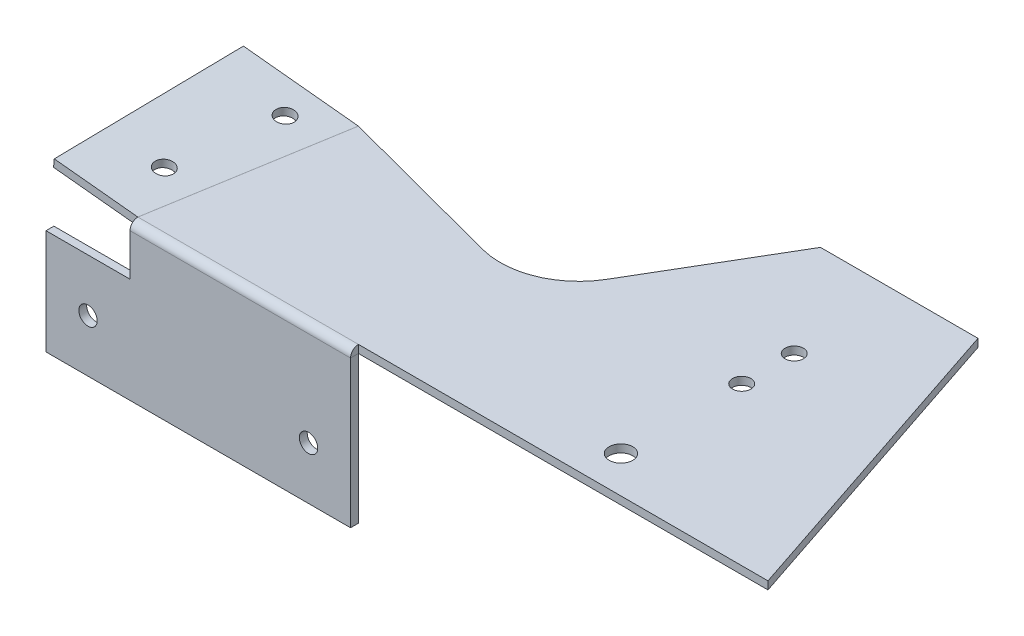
ISO-10303-21;
HEADER;
FILE_DESCRIPTION(('STEP AP214'),'2;1');
FILE_NAME('part.step','',(''),(''),'','','');
FILE_SCHEMA(('AUTOMOTIVE_DESIGN { 1 0 10303 214 1 1 1 1 }'));
ENDSEC;
DATA;
#1=APPLICATION_CONTEXT('core data for automotive mechanical design processes');
#2=APPLICATION_PROTOCOL_DEFINITION('international standard','automotive_design',2000,#1);
#3=PRODUCT_CONTEXT('',#1,'mechanical');
#4=PRODUCT('Part','Part','',(#3));
#5=PRODUCT_RELATED_PRODUCT_CATEGORY('part','',(#4));
#6=PRODUCT_DEFINITION_FORMATION('','',#4);
#7=PRODUCT_DEFINITION_CONTEXT('part definition',#1,'design');
#8=PRODUCT_DEFINITION('design','',#6,#7);
#9=PRODUCT_DEFINITION_SHAPE('','',#8);
#10=(LENGTH_UNIT() NAMED_UNIT(*) SI_UNIT(.MILLI.,.METRE.));
#11=(NAMED_UNIT(*) PLANE_ANGLE_UNIT() SI_UNIT($,.RADIAN.));
#12=(NAMED_UNIT(*) SI_UNIT($,.STERADIAN.) SOLID_ANGLE_UNIT());
#13=UNCERTAINTY_MEASURE_WITH_UNIT(LENGTH_MEASURE(1.E-05),#10,'distance_accuracy_value','');
#14=(GEOMETRIC_REPRESENTATION_CONTEXT(3) GLOBAL_UNCERTAINTY_ASSIGNED_CONTEXT((#13)) GLOBAL_UNIT_ASSIGNED_CONTEXT((#10,
#11,#12)) REPRESENTATION_CONTEXT('',''));
#15=CARTESIAN_POINT('',(0.,0.,0.));
#16=DIRECTION('',(0.,0.,1.));
#17=DIRECTION('',(1.,0.,0.));
#18=AXIS2_PLACEMENT_3D('',#15,#16,#17);
#19=CARTESIAN_POINT('',(58.,0.,-70.));
#20=DIRECTION('',(0.,1.,0.));
#21=DIRECTION('',(0.,0.,1.));
#22=AXIS2_PLACEMENT_3D('',#19,#20,#21);
#23=PLANE('',#22);
#24=CARTESIAN_POINT('',(101.,0.,-68.));
#25=DIRECTION('',(0.,1.,0.));
#26=DIRECTION('',(0.,0.,1.));
#27=AXIS2_PLACEMENT_3D('',#24,#25,#26);
#28=CIRCLE('',#27,1.75);
#29=CARTESIAN_POINT('',(101.,0.,-66.25));
#30=VERTEX_POINT('',#29);
#31=EDGE_CURVE('E336',#30,#30,#28,.T.);
#32=ORIENTED_EDGE('',*,*,#31,.T.);
#33=EDGE_LOOP('',(#32));
#34=FACE_BOUND('',#33,.T.);
#35=CARTESIAN_POINT('',(101.,0.,-35.));
#36=DIRECTION('',(0.,1.,0.));
#37=DIRECTION('',(0.,0.,1.));
#38=AXIS2_PLACEMENT_3D('',#35,#36,#37);
#39=CIRCLE('',#38,2.25);
#40=CARTESIAN_POINT('',(101.,0.,-32.75));
#41=VERTEX_POINT('',#40);
#42=EDGE_CURVE('E340',#41,#41,#39,.T.);
#43=ORIENTED_EDGE('',*,*,#42,.T.);
#44=EDGE_LOOP('',(#43));
#45=FACE_BOUND('',#44,.T.);
#46=CARTESIAN_POINT('',(101.,0.,-58.));
#47=DIRECTION('',(0.,1.,0.));
#48=DIRECTION('',(0.,0.,1.));
#49=AXIS2_PLACEMENT_3D('',#46,#47,#48);
#50=CIRCLE('',#49,1.75);
#51=CARTESIAN_POINT('',(101.,0.,-56.25));
#52=VERTEX_POINT('',#51);
#53=EDGE_CURVE('E343',#52,#52,#50,.T.);
#54=ORIENTED_EDGE('',*,*,#53,.T.);
#55=EDGE_LOOP('',(#54));
#56=FACE_BOUND('',#55,.T.);
#57=DIRECTION('',(1.,0.,0.));
#58=VECTOR('',#57,1.);
#59=CARTESIAN_POINT('',(58.,0.,-28.));
#60=LINE('',#59,#58);
#61=CARTESIAN_POINT('',(16.,0.,-28.));
#62=VERTEX_POINT('',#61);
#63=CARTESIAN_POINT('',(58.,0.,-28.));
#64=VERTEX_POINT('',#63);
#65=EDGE_CURVE('E330',#62,#64,#60,.T.);
#66=ORIENTED_EDGE('',*,*,#65,.F.);
#67=DIRECTION('',(0.164398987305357,0.,-0.986393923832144));
#68=VECTOR('',#67,1.);
#69=CARTESIAN_POINT('',(23.9459459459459,0.,-75.6756756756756));
#70=LINE('',#69,#68);
#71=CARTESIAN_POINT('',(22.0000000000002,0.,-64.));
#72=VERTEX_POINT('',#71);
#73=EDGE_CURVE('E64',#62,#72,#70,.T.);
#74=ORIENTED_EDGE('',*,*,#73,.T.);
#75=DIRECTION('',(-0.966800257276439,0.,-0.255533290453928));
#76=VECTOR('',#75,1.);
#77=CARTESIAN_POINT('',(54.1670006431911,0.,-55.4979961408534));
#78=LINE('',#77,#76);
#79=CARTESIAN_POINT('',(54.1670006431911,0.,-55.4979961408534));
#80=VERTEX_POINT('',#79);
#81=EDGE_CURVE('E395',#80,#72,#78,.T.);
#82=ORIENTED_EDGE('',*,*,#81,.F.);
#83=CARTESIAN_POINT('',(58.,0.,-70.));
#84=DIRECTION('',(0.,-1.,0.));
#85=DIRECTION('',(0.,0.,1.));
#86=AXIS2_PLACEMENT_3D('',#83,#84,#85);
#87=CIRCLE('',#86,15.);
#88=CARTESIAN_POINT('',(70.9270174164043,0.,-62.3913062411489));
#89=VERTEX_POINT('',#88);
#90=EDGE_CURVE('E390',#89,#80,#87,.T.);
#91=ORIENTED_EDGE('',*,*,#90,.F.);
#92=DIRECTION('',(-0.507246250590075,0.,0.861801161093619));
#93=VECTOR('',#92,1.);
#94=CARTESIAN_POINT('',(86.,0.,-88.));
#95=LINE('',#94,#93);
#96=CARTESIAN_POINT('',(86.,0.,-88.));
#97=VERTEX_POINT('',#96);
#98=EDGE_CURVE('E385',#97,#89,#95,.T.);
#99=ORIENTED_EDGE('',*,*,#98,.F.);
#100=DIRECTION('',(-1.,0.,0.));
#101=VECTOR('',#100,1.);
#102=CARTESIAN_POINT('',(116.,0.,-88.));
#103=LINE('',#102,#101);
#104=CARTESIAN_POINT('',(116.,0.,-88.));
#105=VERTEX_POINT('',#104);
#106=EDGE_CURVE('E380',#105,#97,#103,.T.);
#107=ORIENTED_EDGE('',*,*,#106,.F.);
#108=DIRECTION('',(-0.316227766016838,0.,-0.948683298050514));
#109=VECTOR('',#108,1.);
#110=CARTESIAN_POINT('',(136.,0.,-28.));
#111=LINE('',#110,#109);
#112=CARTESIAN_POINT('',(136.,0.,-28.));
#113=VERTEX_POINT('',#112);
#114=EDGE_CURVE('E375',#113,#105,#111,.T.);
#115=ORIENTED_EDGE('',*,*,#114,.F.);
#116=DIRECTION('',(1.,0.,0.));
#117=VECTOR('',#116,1.);
#118=CARTESIAN_POINT('',(58.,0.,-28.));
#119=LINE('',#118,#117);
#120=EDGE_CURVE('E349',#64,#113,#119,.T.);
#121=ORIENTED_EDGE('',*,*,#120,.F.);
#122=EDGE_LOOP('',(#66,#74,#82,#91,#99,#107,#115,#121));
#123=FACE_BOUND('',#122,.T.);
#124=ADVANCED_FACE('F54',(#34,#45,#56,#123),#23,.F.);
#125=CARTESIAN_POINT('',(16.,0.000594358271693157,-26.499));
#126=DIRECTION('',(1.,0.,0.));
#127=DIRECTION('',(0.,1.,0.));
#128=AXIS2_PLACEMENT_3D('',#125,#126,#127);
#129=PLANE('',#128);
#130=DIRECTION('',(0.,-1.,0.));
#131=VECTOR('',#130,1.);
#132=CARTESIAN_POINT('',(16.,0.000594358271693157,-26.499));
#133=LINE('',#132,#131);
#134=CARTESIAN_POINT('',(16.,-0.00100000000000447,-26.499));
#135=VERTEX_POINT('',#134);
#136=CARTESIAN_POINT('',(16.,-7.9994056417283,-26.499));
#137=VERTEX_POINT('',#136);
#138=EDGE_CURVE('E418',#135,#137,#133,.T.);
#139=ORIENTED_EDGE('',*,*,#138,.F.);
#140=DIRECTION('',(0.,0.,-1.));
#141=VECTOR('',#140,1.);
#142=CARTESIAN_POINT('',(16.,-0.00100000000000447,-26.499));
#143=LINE('',#142,#141);
#144=CARTESIAN_POINT('',(16.,-0.000999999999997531,-27.999));
#145=VERTEX_POINT('',#144);
#146=EDGE_CURVE('E443',#135,#145,#143,.T.);
#147=ORIENTED_EDGE('',*,*,#146,.T.);
#148=DIRECTION('',(0.,-1.,0.));
#149=VECTOR('',#148,1.);
#150=CARTESIAN_POINT('',(16.,0.000594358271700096,-27.999));
#151=LINE('',#150,#149);
#152=CARTESIAN_POINT('',(16.,-7.9994056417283,-27.999));
#153=VERTEX_POINT('',#152);
#154=EDGE_CURVE('E80',#145,#153,#151,.T.);
#155=ORIENTED_EDGE('',*,*,#154,.T.);
#156=DIRECTION('',(0.,0.,-1.));
#157=VECTOR('',#156,1.);
#158=CARTESIAN_POINT('',(16.,-7.9994056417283,-26.499));
#159=LINE('',#158,#157);
#160=EDGE_CURVE('E427',#137,#153,#159,.T.);
#161=ORIENTED_EDGE('',*,*,#160,.F.);
#162=EDGE_LOOP('',(#139,#147,#155,#161));
#163=FACE_BOUND('',#162,.T.);
#164=ADVANCED_FACE('F539',(#163),#129,.F.);
#165=CARTESIAN_POINT('',(58.,-27.9994056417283,-26.4990000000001));
#166=DIRECTION('',(-1.,0.,0.));
#167=DIRECTION('',(0.,-1.,0.));
#168=AXIS2_PLACEMENT_3D('',#165,#166,#167);
#169=PLANE('',#168);
#170=DIRECTION('',(0.,1.,0.));
#171=VECTOR('',#170,1.);
#172=CARTESIAN_POINT('',(58.,-27.9994056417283,-27.9990000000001));
#173=LINE('',#172,#171);
#174=CARTESIAN_POINT('',(58.,-27.9994056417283,-27.9990000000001));
#175=VERTEX_POINT('',#174);
#176=CARTESIAN_POINT('',(58.,-0.000999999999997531,-27.999));
#177=VERTEX_POINT('',#176);
#178=EDGE_CURVE('E423',#175,#177,#173,.T.);
#179=ORIENTED_EDGE('',*,*,#178,.T.);
#180=DIRECTION('',(0.,0.,1.));
#181=VECTOR('',#180,1.);
#182=CARTESIAN_POINT('',(58.,-0.00100000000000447,-26.499));
#183=LINE('',#182,#181);
#184=CARTESIAN_POINT('',(58.,-0.00100000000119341,-26.499));
#185=VERTEX_POINT('',#184);
#186=EDGE_CURVE('E439',#177,#185,#183,.T.);
#187=ORIENTED_EDGE('',*,*,#186,.T.);
#188=DIRECTION('',(0.,1.,0.));
#189=VECTOR('',#188,1.);
#190=CARTESIAN_POINT('',(58.,-27.9994056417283,-26.4990000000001));
#191=LINE('',#190,#189);
#192=CARTESIAN_POINT('',(58.,-27.9994056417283,-26.4990000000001));
#193=VERTEX_POINT('',#192);
#194=EDGE_CURVE('E414',#193,#185,#191,.T.);
#195=ORIENTED_EDGE('',*,*,#194,.F.);
#196=DIRECTION('',(0.,0.,-1.));
#197=VECTOR('',#196,1.);
#198=CARTESIAN_POINT('',(58.,-27.9994056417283,-26.4990000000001));
#199=LINE('',#198,#197);
#200=EDGE_CURVE('E430',#193,#175,#199,.T.);
#201=ORIENTED_EDGE('',*,*,#200,.T.);
#202=EDGE_LOOP('',(#179,#187,#195,#201));
#203=FACE_BOUND('',#202,.T.);
#204=ADVANCED_FACE('F544',(#203),#169,.F.);
#205=CARTESIAN_POINT('',(58.,42.0005943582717,-27.9989999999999));
#206=DIRECTION('',(0.,0.,1.));
#207=DIRECTION('',(0.,-1.,0.));
#208=AXIS2_PLACEMENT_3D('',#205,#206,#207);
#209=PLANE('',#208);
#210=CARTESIAN_POINT('',(50.,-17.9994056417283,-27.9990000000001));
#211=DIRECTION('',(0.,0.,1.));
#212=DIRECTION('',(0.,-1.,0.));
#213=AXIS2_PLACEMENT_3D('',#210,#211,#212);
#214=CIRCLE('',#213,1.75);
#215=CARTESIAN_POINT('',(50.,-19.7494056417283,-27.9990000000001));
#216=VERTEX_POINT('',#215);
#217=EDGE_CURVE('E339',#216,#216,#214,.T.);
#218=ORIENTED_EDGE('',*,*,#217,.T.);
#219=EDGE_LOOP('',(#218));
#220=FACE_BOUND('',#219,.T.);
#221=CARTESIAN_POINT('',(8.,-17.9994056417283,-27.9990000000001));
#222=DIRECTION('',(0.,0.,1.));
#223=DIRECTION('',(0.,-1.,0.));
#224=AXIS2_PLACEMENT_3D('',#221,#222,#223);
#225=CIRCLE('',#224,1.75);
#226=CARTESIAN_POINT('',(8.,-19.7494056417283,-27.9990000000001));
#227=VERTEX_POINT('',#226);
#228=EDGE_CURVE('E399',#227,#227,#225,.T.);
#229=ORIENTED_EDGE('',*,*,#228,.T.);
#230=EDGE_LOOP('',(#229));
#231=FACE_BOUND('',#230,.T.);
#232=ORIENTED_EDGE('',*,*,#154,.F.);
#233=DIRECTION('',(1.,0.,0.));
#234=VECTOR('',#233,1.);
#235=CARTESIAN_POINT('',(58.,-0.001000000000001,-27.999));
#236=LINE('',#235,#234);
#237=EDGE_CURVE('E441',#145,#177,#236,.T.);
#238=ORIENTED_EDGE('',*,*,#237,.T.);
#239=ORIENTED_EDGE('',*,*,#178,.F.);
#240=DIRECTION('',(1.,0.,0.));
#241=VECTOR('',#240,1.);
#242=CARTESIAN_POINT('',(0.,-27.9994056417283,-27.9990000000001));
#243=LINE('',#242,#241);
#244=CARTESIAN_POINT('',(0.,-27.9994056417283,-27.9990000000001));
#245=VERTEX_POINT('',#244);
#246=EDGE_CURVE('E421',#245,#175,#243,.T.);
#247=ORIENTED_EDGE('',*,*,#246,.F.);
#248=DIRECTION('',(0.,-1.,0.));
#249=VECTOR('',#248,1.);
#250=CARTESIAN_POINT('',(0.,-7.9994056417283,-27.999));
#251=LINE('',#250,#249);
#252=CARTESIAN_POINT('',(0.,-7.9994056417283,-27.999));
#253=VERTEX_POINT('',#252);
#254=EDGE_CURVE('E405',#253,#245,#251,.T.);
#255=ORIENTED_EDGE('',*,*,#254,.F.);
#256=DIRECTION('',(-1.,0.,0.));
#257=VECTOR('',#256,1.);
#258=CARTESIAN_POINT('',(16.,-7.9994056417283,-27.999));
#259=LINE('',#258,#257);
#260=EDGE_CURVE('E412',#153,#253,#259,.T.);
#261=ORIENTED_EDGE('',*,*,#260,.F.);
#262=EDGE_LOOP('',(#232,#238,#239,#247,#255,#261));
#263=FACE_BOUND('',#262,.T.);
#264=ADVANCED_FACE('F803',(#220,#231,#263),#209,.F.);
#265=CARTESIAN_POINT('',(58.,42.0005943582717,-26.4989999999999));
#266=DIRECTION('',(0.,0.,1.));
#267=DIRECTION('',(0.,-1.,0.));
#268=AXIS2_PLACEMENT_3D('',#265,#266,#267);
#269=PLANE('',#268);
#270=DIRECTION('',(1.,0.,0.));
#271=VECTOR('',#270,1.);
#272=CARTESIAN_POINT('',(58.,-0.00100000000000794,-26.499));
#273=LINE('',#272,#271);
#274=EDGE_CURVE('E436',#135,#185,#273,.T.);
#275=ORIENTED_EDGE('',*,*,#274,.F.);
#276=ORIENTED_EDGE('',*,*,#138,.T.);
#277=DIRECTION('',(-1.,0.,0.));
#278=VECTOR('',#277,1.);
#279=CARTESIAN_POINT('',(16.,-7.9994056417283,-26.499));
#280=LINE('',#279,#278);
#281=CARTESIAN_POINT('',(0.,-7.99940564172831,-26.499));
#282=VERTEX_POINT('',#281);
#283=EDGE_CURVE('E415',#137,#282,#280,.T.);
#284=ORIENTED_EDGE('',*,*,#283,.T.);
#285=DIRECTION('',(0.,-1.,0.));
#286=VECTOR('',#285,1.);
#287=CARTESIAN_POINT('',(0.,-7.99940564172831,-26.499));
#288=LINE('',#287,#286);
#289=CARTESIAN_POINT('',(0.,-27.9994056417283,-26.4990000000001));
#290=VERTEX_POINT('',#289);
#291=EDGE_CURVE('E408',#282,#290,#288,.T.);
#292=ORIENTED_EDGE('',*,*,#291,.T.);
#293=DIRECTION('',(1.,0.,0.));
#294=VECTOR('',#293,1.);
#295=CARTESIAN_POINT('',(0.,-27.9994056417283,-26.4990000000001));
#296=LINE('',#295,#294);
#297=EDGE_CURVE('E411',#290,#193,#296,.T.);
#298=ORIENTED_EDGE('',*,*,#297,.T.);
#299=ORIENTED_EDGE('',*,*,#194,.T.);
#300=EDGE_LOOP('',(#275,#276,#284,#292,#298,#299));
#301=FACE_BOUND('',#300,.T.);
#302=CARTESIAN_POINT('',(50.,-17.9994056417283,-26.4990000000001));
#303=DIRECTION('',(0.,0.,1.));
#304=DIRECTION('',(0.,-1.,0.));
#305=AXIS2_PLACEMENT_3D('',#302,#303,#304);
#306=CIRCLE('',#305,1.75);
#307=CARTESIAN_POINT('',(50.,-19.7494056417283,-26.4990000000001));
#308=VERTEX_POINT('',#307);
#309=EDGE_CURVE('E396',#308,#308,#306,.T.);
#310=ORIENTED_EDGE('',*,*,#309,.F.);
#311=EDGE_LOOP('',(#310));
#312=FACE_BOUND('',#311,.T.);
#313=CARTESIAN_POINT('',(8.,-17.9994056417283,-26.4990000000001));
#314=DIRECTION('',(0.,0.,1.));
#315=DIRECTION('',(0.,-1.,0.));
#316=AXIS2_PLACEMENT_3D('',#313,#314,#315);
#317=CIRCLE('',#316,1.75);
#318=CARTESIAN_POINT('',(8.,-19.7494056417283,-26.4990000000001));
#319=VERTEX_POINT('',#318);
#320=EDGE_CURVE('E402',#319,#319,#317,.T.);
#321=ORIENTED_EDGE('',*,*,#320,.F.);
#322=EDGE_LOOP('',(#321));
#323=FACE_BOUND('',#322,.T.);
#324=ADVANCED_FACE('F795',(#301,#312,#323),#269,.T.);
#325=CARTESIAN_POINT('',(0.,-7.99940564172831,-26.499));
#326=DIRECTION('',(1.,0.,0.));
#327=DIRECTION('',(0.,1.,0.));
#328=AXIS2_PLACEMENT_3D('',#325,#326,#327);
#329=PLANE('',#328);
#330=ORIENTED_EDGE('',*,*,#254,.T.);
#331=DIRECTION('',(0.,0.,-1.));
#332=VECTOR('',#331,1.);
#333=CARTESIAN_POINT('',(0.,-27.9994056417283,-26.4990000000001));
#334=LINE('',#333,#332);
#335=EDGE_CURVE('E433',#290,#245,#334,.T.);
#336=ORIENTED_EDGE('',*,*,#335,.F.);
#337=ORIENTED_EDGE('',*,*,#291,.F.);
#338=DIRECTION('',(0.,0.,-1.));
#339=VECTOR('',#338,1.);
#340=CARTESIAN_POINT('',(0.,-7.99940564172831,-26.499));
#341=LINE('',#340,#339);
#342=EDGE_CURVE('E417',#282,#253,#341,.T.);
#343=ORIENTED_EDGE('',*,*,#342,.T.);
#344=EDGE_LOOP('',(#330,#336,#337,#343));
#345=FACE_BOUND('',#344,.T.);
#346=ADVANCED_FACE('F787',(#345),#329,.F.);
#347=CARTESIAN_POINT('',(0.,-27.9994056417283,-26.4990000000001));
#348=DIRECTION('',(0.,1.,0.));
#349=DIRECTION('',(-1.,0.,0.));
#350=AXIS2_PLACEMENT_3D('',#347,#348,#349);
#351=PLANE('',#350);
#352=ORIENTED_EDGE('',*,*,#246,.T.);
#353=ORIENTED_EDGE('',*,*,#200,.F.);
#354=ORIENTED_EDGE('',*,*,#297,.F.);
#355=ORIENTED_EDGE('',*,*,#335,.T.);
#356=EDGE_LOOP('',(#352,#353,#354,#355));
#357=FACE_BOUND('',#356,.T.);
#358=ADVANCED_FACE('F779',(#357),#351,.F.);
#359=CARTESIAN_POINT('',(16.,-7.9994056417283,-26.499));
#360=DIRECTION('',(0.,-1.,0.));
#361=DIRECTION('',(1.,0.,0.));
#362=AXIS2_PLACEMENT_3D('',#359,#360,#361);
#363=PLANE('',#362);
#364=ORIENTED_EDGE('',*,*,#260,.T.);
#365=ORIENTED_EDGE('',*,*,#342,.F.);
#366=ORIENTED_EDGE('',*,*,#283,.F.);
#367=ORIENTED_EDGE('',*,*,#160,.T.);
#368=EDGE_LOOP('',(#364,#365,#366,#367));
#369=FACE_BOUND('',#368,.T.);
#370=ADVANCED_FACE('F771',(#369),#363,.F.);
#371=CARTESIAN_POINT('',(8.,-17.9994056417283,-26.4990000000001));
#372=DIRECTION('',(0.,0.,-1.));
#373=DIRECTION('',(0.,1.,0.));
#374=AXIS2_PLACEMENT_3D('',#371,#372,#373);
#375=CYLINDRICAL_SURFACE('',#374,1.75);
#376=ORIENTED_EDGE('',*,*,#320,.T.);
#377=EDGE_LOOP('',(#376));
#378=FACE_BOUND('',#377,.T.);
#379=ORIENTED_EDGE('',*,*,#228,.F.);
#380=EDGE_LOOP('',(#379));
#381=FACE_BOUND('',#380,.T.);
#382=ADVANCED_FACE('F763',(#378,#381),#375,.F.);
#383=CARTESIAN_POINT('',(50.,-17.9994056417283,-26.4990000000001));
#384=DIRECTION('',(0.,0.,-1.));
#385=DIRECTION('',(0.,1.,0.));
#386=AXIS2_PLACEMENT_3D('',#383,#384,#385);
#387=CYLINDRICAL_SURFACE('',#386,1.75);
#388=ORIENTED_EDGE('',*,*,#309,.T.);
#389=EDGE_LOOP('',(#388));
#390=FACE_BOUND('',#389,.T.);
#391=ORIENTED_EDGE('',*,*,#217,.F.);
#392=EDGE_LOOP('',(#391));
#393=FACE_BOUND('',#392,.T.);
#394=ADVANCED_FACE('F487',(#390,#393),#387,.F.);
#395=CARTESIAN_POINT('',(54.1670006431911,1.5,-55.4979961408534));
#396=DIRECTION('',(-0.255533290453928,0.,0.966800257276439));
#397=DIRECTION('',(0.966800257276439,0.,0.255533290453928));
#398=AXIS2_PLACEMENT_3D('',#395,#396,#397);
#399=PLANE('',#398);
#400=ORIENTED_EDGE('',*,*,#81,.T.);
#401=CARTESIAN_POINT('',(22.,1.5,-64.));
#402=CARTESIAN_POINT('',(22.0000000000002,0.,-64.));
#403=B_SPLINE_CURVE_WITH_KNOTS('',1,(#401,#402),.UNSPECIFIED.,.F.,.F.,(2,2),(0.,1.),.UNSPECIFIED.);
#404=CARTESIAN_POINT('',(22.,1.5,-64.));
#405=VERTEX_POINT('',#404);
#406=EDGE_CURVE('E318',#405,#72,#403,.T.);
#407=ORIENTED_EDGE('',*,*,#406,.F.);
#408=DIRECTION('',(-0.966800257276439,0.,-0.255533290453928));
#409=VECTOR('',#408,1.);
#410=CARTESIAN_POINT('',(54.1670006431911,1.5,-55.4979961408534));
#411=LINE('',#410,#409);
#412=CARTESIAN_POINT('',(54.1670006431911,1.5,-55.4979961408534));
#413=VERTEX_POINT('',#412);
#414=EDGE_CURVE('E351',#413,#405,#411,.T.);
#415=ORIENTED_EDGE('',*,*,#414,.F.);
#416=DIRECTION('',(0.,-1.,0.));
#417=VECTOR('',#416,1.);
#418=CARTESIAN_POINT('',(54.1670006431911,1.5,-55.4979961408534));
#419=LINE('',#418,#417);
#420=EDGE_CURVE('E392',#413,#80,#419,.T.);
#421=ORIENTED_EDGE('',*,*,#420,.T.);
#422=EDGE_LOOP('',(#400,#407,#415,#421));
#423=FACE_BOUND('',#422,.T.);
#424=ADVANCED_FACE('F482',(#423),#399,.F.);
#425=CARTESIAN_POINT('',(58.,1.5,-70.));
#426=DIRECTION('',(0.,-1.,0.));
#427=DIRECTION('',(0.,0.,-1.));
#428=AXIS2_PLACEMENT_3D('',#425,#426,#427);
#429=CYLINDRICAL_SURFACE('',#428,15.);
#430=ORIENTED_EDGE('',*,*,#90,.T.);
#431=ORIENTED_EDGE('',*,*,#420,.F.);
#432=CARTESIAN_POINT('',(58.,1.5,-70.));
#433=DIRECTION('',(0.,-1.,0.));
#434=DIRECTION('',(0.,0.,1.));
#435=AXIS2_PLACEMENT_3D('',#432,#433,#434);
#436=CIRCLE('',#435,15.);
#437=CARTESIAN_POINT('',(70.9270174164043,1.5,-62.3913062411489));
#438=VERTEX_POINT('',#437);
#439=EDGE_CURVE('E352',#438,#413,#436,.T.);
#440=ORIENTED_EDGE('',*,*,#439,.F.);
#441=DIRECTION('',(0.,-1.,0.));
#442=VECTOR('',#441,1.);
#443=CARTESIAN_POINT('',(70.9270174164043,1.5,-62.3913062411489));
#444=LINE('',#443,#442);
#445=EDGE_CURVE('E387',#438,#89,#444,.T.);
#446=ORIENTED_EDGE('',*,*,#445,.T.);
#447=EDGE_LOOP('',(#430,#431,#440,#446));
#448=FACE_BOUND('',#447,.T.);
#449=ADVANCED_FACE('F486',(#448),#429,.F.);
#450=CARTESIAN_POINT('',(86.,1.5,-88.));
#451=DIRECTION('',(0.861801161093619,0.,0.507246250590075));
#452=DIRECTION('',(0.507246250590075,0.,-0.861801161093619));
#453=AXIS2_PLACEMENT_3D('',#450,#451,#452);
#454=PLANE('',#453);
#455=ORIENTED_EDGE('',*,*,#98,.T.);
#456=ORIENTED_EDGE('',*,*,#445,.F.);
#457=DIRECTION('',(-0.507246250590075,0.,0.861801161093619));
#458=VECTOR('',#457,1.);
#459=CARTESIAN_POINT('',(86.,1.5,-88.));
#460=LINE('',#459,#458);
#461=CARTESIAN_POINT('',(86.,1.5,-88.));
#462=VERTEX_POINT('',#461);
#463=EDGE_CURVE('E354',#462,#438,#460,.T.);
#464=ORIENTED_EDGE('',*,*,#463,.F.);
#465=DIRECTION('',(0.,-1.,0.));
#466=VECTOR('',#465,1.);
#467=CARTESIAN_POINT('',(86.,1.5,-88.));
#468=LINE('',#467,#466);
#469=EDGE_CURVE('E382',#462,#97,#468,.T.);
#470=ORIENTED_EDGE('',*,*,#469,.T.);
#471=EDGE_LOOP('',(#455,#456,#464,#470));
#472=FACE_BOUND('',#471,.T.);
#473=ADVANCED_FACE('F740',(#472),#454,.F.);
#474=CARTESIAN_POINT('',(116.,1.5,-88.));
#475=DIRECTION('',(0.,0.,1.));
#476=DIRECTION('',(1.,0.,0.));
#477=AXIS2_PLACEMENT_3D('',#474,#475,#476);
#478=PLANE('',#477);
#479=ORIENTED_EDGE('',*,*,#106,.T.);
#480=ORIENTED_EDGE('',*,*,#469,.F.);
#481=DIRECTION('',(-1.,0.,0.));
#482=VECTOR('',#481,1.);
#483=CARTESIAN_POINT('',(116.,1.5,-88.));
#484=LINE('',#483,#482);
#485=CARTESIAN_POINT('',(116.,1.5,-88.));
#486=VERTEX_POINT('',#485);
#487=EDGE_CURVE('E356',#486,#462,#484,.T.);
#488=ORIENTED_EDGE('',*,*,#487,.F.);
#489=DIRECTION('',(0.,-1.,0.));
#490=VECTOR('',#489,1.);
#491=CARTESIAN_POINT('',(116.,1.5,-88.));
#492=LINE('',#491,#490);
#493=EDGE_CURVE('E377',#486,#105,#492,.T.);
#494=ORIENTED_EDGE('',*,*,#493,.T.);
#495=EDGE_LOOP('',(#479,#480,#488,#494));
#496=FACE_BOUND('',#495,.T.);
#497=ADVANCED_FACE('F732',(#496),#478,.F.);
#498=CARTESIAN_POINT('',(136.,1.5,-28.));
#499=DIRECTION('',(-0.948683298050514,0.,0.316227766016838));
#500=DIRECTION('',(0.316227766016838,0.,0.948683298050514));
#501=AXIS2_PLACEMENT_3D('',#498,#499,#500);
#502=PLANE('',#501);
#503=ORIENTED_EDGE('',*,*,#114,.T.);
#504=ORIENTED_EDGE('',*,*,#493,.F.);
#505=DIRECTION('',(-0.316227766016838,0.,-0.948683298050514));
#506=VECTOR('',#505,1.);
#507=CARTESIAN_POINT('',(136.,1.5,-28.));
#508=LINE('',#507,#506);
#509=CARTESIAN_POINT('',(136.,1.5,-28.));
#510=VERTEX_POINT('',#509);
#511=EDGE_CURVE('E358',#510,#486,#508,.T.);
#512=ORIENTED_EDGE('',*,*,#511,.F.);
#513=DIRECTION('',(0.,-1.,0.));
#514=VECTOR('',#513,1.);
#515=CARTESIAN_POINT('',(136.,1.5,-28.));
#516=LINE('',#515,#514);
#517=EDGE_CURVE('E372',#510,#113,#516,.T.);
#518=ORIENTED_EDGE('',*,*,#517,.T.);
#519=EDGE_LOOP('',(#503,#504,#512,#518));
#520=FACE_BOUND('',#519,.T.);
#521=ADVANCED_FACE('F724',(#520),#502,.F.);
#522=CARTESIAN_POINT('',(101.,1.5,-58.));
#523=DIRECTION('',(0.,-1.,0.));
#524=DIRECTION('',(0.,0.,-1.));
#525=AXIS2_PLACEMENT_3D('',#522,#523,#524);
#526=CYLINDRICAL_SURFACE('',#525,1.75);
#527=CARTESIAN_POINT('',(101.,1.5,-58.));
#528=DIRECTION('',(0.,1.,0.));
#529=DIRECTION('',(0.,0.,1.));
#530=AXIS2_PLACEMENT_3D('',#527,#528,#529);
#531=CIRCLE('',#530,1.75);
#532=CARTESIAN_POINT('',(101.,1.5,-56.25));
#533=VERTEX_POINT('',#532);
#534=EDGE_CURVE('E369',#533,#533,#531,.T.);
#535=ORIENTED_EDGE('',*,*,#534,.T.);
#536=EDGE_LOOP('',(#535));
#537=FACE_BOUND('',#536,.T.);
#538=ORIENTED_EDGE('',*,*,#53,.F.);
#539=EDGE_LOOP('',(#538));
#540=FACE_BOUND('',#539,.T.);
#541=ADVANCED_FACE('F716',(#537,#540),#526,.F.);
#542=CARTESIAN_POINT('',(101.,1.5,-35.));
#543=DIRECTION('',(0.,-1.,0.));
#544=DIRECTION('',(0.,0.,-1.));
#545=AXIS2_PLACEMENT_3D('',#542,#543,#544);
#546=CYLINDRICAL_SURFACE('',#545,2.25);
#547=CARTESIAN_POINT('',(101.,1.5,-35.));
#548=DIRECTION('',(0.,1.,0.));
#549=DIRECTION('',(0.,0.,1.));
#550=AXIS2_PLACEMENT_3D('',#547,#548,#549);
#551=CIRCLE('',#550,2.25);
#552=CARTESIAN_POINT('',(101.,1.5,-32.75));
#553=VERTEX_POINT('',#552);
#554=EDGE_CURVE('E366',#553,#553,#551,.T.);
#555=ORIENTED_EDGE('',*,*,#554,.T.);
#556=EDGE_LOOP('',(#555));
#557=FACE_BOUND('',#556,.T.);
#558=ORIENTED_EDGE('',*,*,#42,.F.);
#559=EDGE_LOOP('',(#558));
#560=FACE_BOUND('',#559,.T.);
#561=ADVANCED_FACE('F708',(#557,#560),#546,.F.);
#562=CARTESIAN_POINT('',(101.,1.5,-68.));
#563=DIRECTION('',(0.,-1.,0.));
#564=DIRECTION('',(0.,0.,-1.));
#565=AXIS2_PLACEMENT_3D('',#562,#563,#564);
#566=CYLINDRICAL_SURFACE('',#565,1.75);
#567=CARTESIAN_POINT('',(101.,1.5,-68.));
#568=DIRECTION('',(0.,1.,0.));
#569=DIRECTION('',(0.,0.,1.));
#570=AXIS2_PLACEMENT_3D('',#567,#568,#569);
#571=CIRCLE('',#570,1.75);
#572=CARTESIAN_POINT('',(101.,1.5,-66.25));
#573=VERTEX_POINT('',#572);
#574=EDGE_CURVE('E363',#573,#573,#571,.T.);
#575=ORIENTED_EDGE('',*,*,#574,.T.);
#576=EDGE_LOOP('',(#575));
#577=FACE_BOUND('',#576,.T.);
#578=ORIENTED_EDGE('',*,*,#31,.F.);
#579=EDGE_LOOP('',(#578));
#580=FACE_BOUND('',#579,.T.);
#581=ADVANCED_FACE('F702',(#577,#580),#566,.F.);
#582=CARTESIAN_POINT('',(58.,1.5,-70.));
#583=DIRECTION('',(0.,1.,0.));
#584=DIRECTION('',(0.,0.,1.));
#585=AXIS2_PLACEMENT_3D('',#582,#583,#584);
#586=PLANE('',#585);
#587=DIRECTION('',(0.164398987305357,0.,-0.986393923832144));
#588=VECTOR('',#587,1.);
#589=CARTESIAN_POINT('',(23.9459459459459,1.5,-75.6756756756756));
#590=LINE('',#589,#588);
#591=CARTESIAN_POINT('',(16.,1.5,-28.));
#592=VERTEX_POINT('',#591);
#593=EDGE_CURVE('E445',#592,#405,#590,.T.);
#594=ORIENTED_EDGE('',*,*,#593,.F.);
#595=DIRECTION('',(1.,0.,0.));
#596=VECTOR('',#595,1.);
#597=CARTESIAN_POINT('',(58.,1.5,-28.));
#598=LINE('',#597,#596);
#599=CARTESIAN_POINT('',(58.,1.5,-28.));
#600=VERTEX_POINT('',#599);
#601=EDGE_CURVE('E362',#592,#600,#598,.T.);
#602=ORIENTED_EDGE('',*,*,#601,.T.);
#603=DIRECTION('',(1.,0.,0.));
#604=VECTOR('',#603,1.);
#605=CARTESIAN_POINT('',(58.,1.5,-28.));
#606=LINE('',#605,#604);
#607=EDGE_CURVE('E360',#600,#510,#606,.T.);
#608=ORIENTED_EDGE('',*,*,#607,.T.);
#609=ORIENTED_EDGE('',*,*,#511,.T.);
#610=ORIENTED_EDGE('',*,*,#487,.T.);
#611=ORIENTED_EDGE('',*,*,#463,.T.);
#612=ORIENTED_EDGE('',*,*,#439,.T.);
#613=ORIENTED_EDGE('',*,*,#414,.T.);
#614=EDGE_LOOP('',(#594,#602,#608,#609,#610,#611,#612,#613));
#615=FACE_BOUND('',#614,.T.);
#616=ORIENTED_EDGE('',*,*,#574,.F.);
#617=EDGE_LOOP('',(#616));
#618=FACE_BOUND('',#617,.T.);
#619=ORIENTED_EDGE('',*,*,#554,.F.);
#620=EDGE_LOOP('',(#619));
#621=FACE_BOUND('',#620,.T.);
#622=ORIENTED_EDGE('',*,*,#534,.F.);
#623=EDGE_LOOP('',(#622));
#624=FACE_BOUND('',#623,.T.);
#625=ADVANCED_FACE('F581',(#615,#618,#621,#624),#586,.T.);
#626=CARTESIAN_POINT('',(58.,1.5,-28.));
#627=DIRECTION('',(0.,0.,-1.));
#628=DIRECTION('',(-1.,0.,0.));
#629=AXIS2_PLACEMENT_3D('',#626,#627,#628);
#630=PLANE('',#629);
#631=ORIENTED_EDGE('',*,*,#120,.T.);
#632=ORIENTED_EDGE('',*,*,#517,.F.);
#633=ORIENTED_EDGE('',*,*,#607,.F.);
#634=DIRECTION('',(0.,-1.,0.));
#635=VECTOR('',#634,1.);
#636=CARTESIAN_POINT('',(58.,1.5,-28.));
#637=LINE('',#636,#635);
#638=EDGE_CURVE('E346',#600,#64,#637,.T.);
#639=ORIENTED_EDGE('',*,*,#638,.T.);
#640=EDGE_LOOP('',(#631,#632,#633,#639));
#641=FACE_BOUND('',#640,.T.);
#642=ADVANCED_FACE('F481',(#641),#630,.F.);
#643=CARTESIAN_POINT('',(16.,-0.000999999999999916,-28.));
#644=DIRECTION('',(-1.,0.,0.));
#645=DIRECTION('',(0.,0.,1.));
#646=AXIS2_PLACEMENT_3D('',#643,#644,#645);
#647=PLANE('',#646);
#648=CARTESIAN_POINT('',(16.0000000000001,0.,-28.));
#649=CARTESIAN_POINT('',(16.,1.5,-28.));
#650=B_SPLINE_CURVE_WITH_KNOTS('',1,(#648,#649),.UNSPECIFIED.,.F.,.F.,(2,2),(0.,1.),.UNSPECIFIED.);
#651=EDGE_CURVE('E12',#592,#62,#650,.F.);
#652=ORIENTED_EDGE('',*,*,#651,.T.);
#653=CARTESIAN_POINT('',(16.,-0.000999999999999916,-28.));
#654=DIRECTION('',(1.,0.,0.));
#655=DIRECTION('',(0.,0.,-1.));
#656=AXIS2_PLACEMENT_3D('',#653,#654,#655);
#657=CIRCLE('',#656,0.000999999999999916);
#658=EDGE_CURVE('E335',#62,#145,#657,.T.);
#659=ORIENTED_EDGE('',*,*,#658,.T.);
#660=ORIENTED_EDGE('',*,*,#146,.F.);
#661=CARTESIAN_POINT('',(16.,-0.000999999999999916,-28.));
#662=DIRECTION('',(1.,0.,0.));
#663=DIRECTION('',(0.,0.,-1.));
#664=AXIS2_PLACEMENT_3D('',#661,#662,#663);
#665=CIRCLE('',#664,1.501);
#666=EDGE_CURVE('E331',#592,#135,#665,.T.);
#667=ORIENTED_EDGE('',*,*,#666,.F.);
#668=EDGE_LOOP('',(#652,#659,#660,#667));
#669=FACE_BOUND('',#668,.T.);
#670=ADVANCED_FACE('F470',(#669),#647,.T.);
#671=CARTESIAN_POINT('',(58.,-0.000999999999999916,-28.));
#672=DIRECTION('',(1.,0.,0.));
#673=DIRECTION('',(0.,0.,-1.));
#674=AXIS2_PLACEMENT_3D('',#671,#672,#673);
#675=PLANE('',#674);
#676=ORIENTED_EDGE('',*,*,#186,.F.);
#677=CARTESIAN_POINT('',(58.,-0.000999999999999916,-28.));
#678=DIRECTION('',(1.,0.,0.));
#679=DIRECTION('',(0.,0.,-1.));
#680=AXIS2_PLACEMENT_3D('',#677,#678,#679);
#681=CIRCLE('',#680,0.000999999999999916);
#682=EDGE_CURVE('E332',#177,#64,#681,.F.);
#683=ORIENTED_EDGE('',*,*,#682,.T.);
#684=ORIENTED_EDGE('',*,*,#638,.F.);
#685=CARTESIAN_POINT('',(58.,-0.000999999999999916,-28.));
#686=DIRECTION('',(-1.,0.,0.));
#687=DIRECTION('',(0.,0.,1.));
#688=AXIS2_PLACEMENT_3D('',#685,#686,#687);
#689=CIRCLE('',#688,1.501);
#690=EDGE_CURVE('E322',#185,#600,#689,.T.);
#691=ORIENTED_EDGE('',*,*,#690,.F.);
#692=EDGE_LOOP('',(#676,#683,#684,#691));
#693=FACE_BOUND('',#692,.T.);
#694=ADVANCED_FACE('F480',(#693),#675,.T.);
#695=CARTESIAN_POINT('',(-5.02677720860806,-0.000999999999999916,-28.));
#696=DIRECTION('',(1.,0.,0.));
#697=DIRECTION('',(0.,0.,-1.));
#698=AXIS2_PLACEMENT_3D('',#695,#696,#697);
#699=CYLINDRICAL_SURFACE('',#698,1.501);
#700=ORIENTED_EDGE('',*,*,#690,.T.);
#701=ORIENTED_EDGE('',*,*,#601,.F.);
#702=ORIENTED_EDGE('',*,*,#666,.T.);
#703=ORIENTED_EDGE('',*,*,#274,.T.);
#704=EDGE_LOOP('',(#700,#701,#702,#703));
#705=FACE_BOUND('',#704,.T.);
#706=ADVANCED_FACE('F292',(#705),#699,.T.);
#707=CARTESIAN_POINT('',(-5.02677720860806,-0.000999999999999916,-28.));
#708=DIRECTION('',(1.,0.,0.));
#709=DIRECTION('',(0.,0.,-1.));
#710=AXIS2_PLACEMENT_3D('',#707,#708,#709);
#711=CYLINDRICAL_SURFACE('',#710,0.000999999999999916);
#712=ORIENTED_EDGE('',*,*,#682,.F.);
#713=ORIENTED_EDGE('',*,*,#237,.F.);
#714=ORIENTED_EDGE('',*,*,#658,.F.);
#715=ORIENTED_EDGE('',*,*,#65,.T.);
#716=EDGE_LOOP('',(#712,#713,#714,#715));
#717=FACE_BOUND('',#716,.T.);
#718=ADVANCED_FACE('F561',(#717),#711,.F.);
#719=CARTESIAN_POINT('',(15.8347430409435,0.00876496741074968,-28.0257731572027));
#720=CARTESIAN_POINT('',(15.8896277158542,0.00292697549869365,-28.0172154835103));
#721=CARTESIAN_POINT('',(15.944813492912,0.,-28.0086077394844));
#722=CARTESIAN_POINT('',(16.0000000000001,0.,-28.));
#723=CARTESIAN_POINT('',(15.9894024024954,1.50054781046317,-27.999996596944));
#724=CARTESIAN_POINT('',(15.9929223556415,1.50018293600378,-27.9999997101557));
#725=CARTESIAN_POINT('',(15.9964611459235,1.5,-27.9999997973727));
#726=CARTESIAN_POINT('',(16.,1.5,-28.));
#727=B_SPLINE_SURFACE_WITH_KNOTS('',1,3,((#719,#720,#721,#722),(#723,#724,#725,#726)),
.UNSPECIFIED.,.F.,.F.,.F.,(2,2),(4,4),(0.,1.),(0.,1.),.UNSPECIFIED.);
#728=CARTESIAN_POINT('',(15.9894024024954,1.50054781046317,-27.999996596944));
#729=CARTESIAN_POINT('',(15.8347430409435,0.00876496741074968,-28.0257731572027));
#730=B_SPLINE_CURVE_WITH_KNOTS('',1,(#728,#729),.UNSPECIFIED.,.F.,.F.,(2,2),(0.,1.),.UNSPECIFIED.);
#731=CARTESIAN_POINT('',(15.9894024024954,1.50054781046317,-27.999996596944));
#732=VERTEX_POINT('',#731);
#733=CARTESIAN_POINT('',(15.8347430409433,0.00876496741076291,-28.0257731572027));
#734=VERTEX_POINT('',#733);
#735=EDGE_CURVE('E600',#732,#734,#730,.T.);
#736=CARTESIAN_POINT('',(15.8347430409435,0.00876496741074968,-28.0257731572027));
#737=CARTESIAN_POINT('',(15.8896277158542,0.00292697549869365,-28.0172154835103));
#738=CARTESIAN_POINT('',(15.944813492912,0.,-28.0086077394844));
#739=CARTESIAN_POINT('',(16.0000000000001,0.,-28.));
#740=B_SPLINE_CURVE_WITH_KNOTS('',3,(#736,#737,#738,#739),.UNSPECIFIED.,.F.,.F.,(4,4),(0.,1.),.UNSPECIFIED.);
#741=EDGE_CURVE('E71',#734,#62,#740,.T.);
#742=CARTESIAN_POINT('',(16.,1.5,-28.));
#743=CARTESIAN_POINT('',(15.9964611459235,1.5,-27.9999997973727));
#744=CARTESIAN_POINT('',(15.9929223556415,1.50018293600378,-27.9999997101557));
#745=CARTESIAN_POINT('',(15.9894024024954,1.50054781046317,-27.999996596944));
#746=B_SPLINE_CURVE_WITH_KNOTS('',3,(#742,#743,#744,#745),.UNSPECIFIED.,.F.,.F.,(4,4),(0.,1.),.UNSPECIFIED.);
#747=EDGE_CURVE('E586',#732,#592,#746,.F.);
#748=ORIENTED_EDGE('',*,*,#735,.T.);
#749=ORIENTED_EDGE('',*,*,#741,.T.);
#750=ORIENTED_EDGE('',*,*,#651,.F.);
#751=ORIENTED_EDGE('',*,*,#747,.F.);
#752=EDGE_LOOP('',(#748,#749,#750,#751));
#753=FACE_BOUND('',#752,.T.);
#754=ADVANCED_FACE('F233',(#753),#727,.F.);
#755=CARTESIAN_POINT('',(22.0000000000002,0.,-64.));
#756=CARTESIAN_POINT('',(21.9448135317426,0.,-64.0086079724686));
#757=CARTESIAN_POINT('',(21.8896277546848,0.00292697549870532,-64.0172157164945));
#758=CARTESIAN_POINT('',(21.8347430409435,0.00876496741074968,-64.0257731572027));
#759=CARTESIAN_POINT('',(22.,1.5,-64.));
#760=CARTESIAN_POINT('',(21.9964611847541,1.5,-64.0000000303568));
#761=CARTESIAN_POINT('',(21.9929223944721,1.5001829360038,-63.9999999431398));
#762=CARTESIAN_POINT('',(21.9894024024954,1.50054781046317,-63.9999965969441));
#763=B_SPLINE_SURFACE_WITH_KNOTS('',1,3,((#755,#756,#757,#758),(#759,#760,#761,#762)),
.UNSPECIFIED.,.F.,.F.,.F.,(2,2),(4,4),(0.,1.),(0.,1.),.UNSPECIFIED.);
#764=CARTESIAN_POINT('',(22.0000000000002,0.,-64.));
#765=CARTESIAN_POINT('',(21.9448135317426,0.,-64.0086079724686));
#766=CARTESIAN_POINT('',(21.8896277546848,0.00292697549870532,-64.0172157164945));
#767=CARTESIAN_POINT('',(21.8347430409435,0.00876496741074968,-64.0257731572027));
#768=B_SPLINE_CURVE_WITH_KNOTS('',3,(#764,#765,#766,#767),.UNSPECIFIED.,.F.,.F.,(4,4),(0.,1.),.UNSPECIFIED.);
#769=CARTESIAN_POINT('',(21.8347430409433,0.00876496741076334,-64.0257731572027));
#770=VERTEX_POINT('',#769);
#771=EDGE_CURVE('E261',#72,#770,#768,.T.);
#772=CARTESIAN_POINT('',(21.8347430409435,0.00876496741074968,-64.0257731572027));
#773=CARTESIAN_POINT('',(21.9894024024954,1.50054781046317,-63.9999965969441));
#774=B_SPLINE_CURVE_WITH_KNOTS('',1,(#772,#773),.UNSPECIFIED.,.F.,.F.,(2,2),(0.,1.),.UNSPECIFIED.);
#775=CARTESIAN_POINT('',(21.9894024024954,1.50054781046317,-63.999996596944));
#776=VERTEX_POINT('',#775);
#777=EDGE_CURVE('E191',#770,#776,#774,.T.);
#778=CARTESIAN_POINT('',(21.9894024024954,1.50054781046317,-63.9999965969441));
#779=CARTESIAN_POINT('',(21.9929223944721,1.5001829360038,-63.9999999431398));
#780=CARTESIAN_POINT('',(21.9964611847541,1.5,-64.0000000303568));
#781=CARTESIAN_POINT('',(22.,1.5,-64.));
#782=B_SPLINE_CURVE_WITH_KNOTS('',3,(#778,#779,#780,#781),.UNSPECIFIED.,.F.,.F.,(4,4),(0.,1.),.UNSPECIFIED.);
#783=EDGE_CURVE('E256',#405,#776,#782,.F.);
#784=ORIENTED_EDGE('',*,*,#771,.T.);
#785=ORIENTED_EDGE('',*,*,#777,.T.);
#786=ORIENTED_EDGE('',*,*,#783,.F.);
#787=ORIENTED_EDGE('',*,*,#406,.T.);
#788=EDGE_LOOP('',(#784,#785,#786,#787));
#789=FACE_BOUND('',#788,.T.);
#790=ADVANCED_FACE('F231',(#789),#763,.F.);
#791=CARTESIAN_POINT('',(25.0053524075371,1.6,-82.0321144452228));
#792=DIRECTION('',(-0.164398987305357,0.,0.986393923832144));
#793=DIRECTION('',(0.986393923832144,0.,0.164398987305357));
#794=AXIS2_PLACEMENT_3D('',#791,#792,#793);
#795=CYLINDRICAL_SURFACE('',#794,0.1);
#796=ORIENTED_EDGE('',*,*,#593,.T.);
#797=ORIENTED_EDGE('',*,*,#783,.T.);
#798=DIRECTION('',(0.164398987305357,0.,-0.986393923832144));
#799=VECTOR('',#798,1.);
#800=CARTESIAN_POINT('',(23.9356353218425,1.50054781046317,-75.6773941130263));
#801=LINE('',#800,#799);
#802=EDGE_CURVE('E507',#732,#776,#801,.T.);
#803=ORIENTED_EDGE('',*,*,#802,.F.);
#804=ORIENTED_EDGE('',*,*,#747,.T.);
#805=EDGE_LOOP('',(#796,#797,#803,#804));
#806=FACE_BOUND('',#805,.T.);
#807=ADVANCED_FACE('F221',(#806),#795,.F.);
#808=CARTESIAN_POINT('',(25.0053524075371,1.6,-82.0321144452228));
#809=DIRECTION('',(-0.164398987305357,0.,0.986393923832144));
#810=DIRECTION('',(0.986393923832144,0.,0.164398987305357));
#811=AXIS2_PLACEMENT_3D('',#808,#809,#810);
#812=CYLINDRICAL_SURFACE('',#811,1.6);
#813=ORIENTED_EDGE('',*,*,#73,.F.);
#814=ORIENTED_EDGE('',*,*,#741,.F.);
#815=DIRECTION('',(0.164398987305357,0.,-0.986393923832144));
#816=VECTOR('',#815,1.);
#817=CARTESIAN_POINT('',(23.7809759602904,0.00876496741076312,-75.7031706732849));
#818=LINE('',#817,#816);
#819=EDGE_CURVE('E212',#734,#770,#818,.T.);
#820=ORIENTED_EDGE('',*,*,#819,.T.);
#821=ORIENTED_EDGE('',*,*,#771,.F.);
#822=EDGE_LOOP('',(#813,#814,#820,#821));
#823=FACE_BOUND('',#822,.T.);
#824=ADVANCED_FACE('F230',(#823),#812,.T.);
#825=CARTESIAN_POINT('',(0.117224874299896,3.76779032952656,-63.98046252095));
#826=DIRECTION('',(0.994669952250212,-0.103106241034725,-0.000888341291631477));
#827=DIRECTION('',(0.000888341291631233,0.0171843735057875,-0.999851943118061));
#828=AXIS2_PLACEMENT_3D('',#825,#826,#827);
#829=PLANE('',#828);
#830=DIRECTION('',(-0.000888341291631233,-0.0171843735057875,0.999851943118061));
#831=VECTOR('',#830,1.);
#832=CARTESIAN_POINT('',(-0.0374344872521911,2.27600748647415,-64.0062390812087));
#833=LINE('',#832,#831);
#834=CARTESIAN_POINT('',(-0.0374344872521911,2.27600748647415,-64.0062390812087));
#835=VERTEX_POINT('',#834);
#836=CARTESIAN_POINT('',(-0.0694147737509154,1.65737004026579,-28.0115691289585));
#837=VERTEX_POINT('',#836);
#838=EDGE_CURVE('E203',#835,#837,#833,.T.);
#839=ORIENTED_EDGE('',*,*,#838,.T.);
#840=DIRECTION('',(-0.103106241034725,-0.994521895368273,-0.0171843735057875));
#841=VECTOR('',#840,1.);
#842=CARTESIAN_POINT('',(0.0852445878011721,3.1491528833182,-27.9857925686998));
#843=LINE('',#842,#841);
#844=CARTESIAN_POINT('',(0.0852445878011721,3.1491528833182,-27.9857925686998));
#845=VERTEX_POINT('',#844);
#846=EDGE_CURVE('E591',#845,#837,#843,.T.);
#847=ORIENTED_EDGE('',*,*,#846,.F.);
#848=DIRECTION('',(-0.000888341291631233,-0.0171843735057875,0.999851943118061));
#849=VECTOR('',#848,1.);
#850=CARTESIAN_POINT('',(0.117224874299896,3.76779032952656,-63.98046252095));
#851=LINE('',#850,#849);
#852=CARTESIAN_POINT('',(0.117224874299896,3.76779032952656,-63.98046252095));
#853=VERTEX_POINT('',#852);
#854=EDGE_CURVE('E198',#853,#845,#851,.T.);
#855=ORIENTED_EDGE('',*,*,#854,.F.);
#856=DIRECTION('',(-0.103106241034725,-0.994521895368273,-0.0171843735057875));
#857=VECTOR('',#856,1.);
#858=CARTESIAN_POINT('',(0.117224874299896,3.76779032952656,-63.98046252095));
#859=LINE('',#858,#857);
#860=EDGE_CURVE('E188',#853,#835,#859,.T.);
#861=ORIENTED_EDGE('',*,*,#860,.T.);
#862=EDGE_LOOP('',(#839,#847,#855,#861));
#863=FACE_BOUND('',#862,.T.);
#864=ADVANCED_FACE('F201',(#863),#829,.F.);
#865=CARTESIAN_POINT('',(14.0372741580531,2.22119671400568,-57.9937876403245));
#866=DIRECTION('',(-0.103106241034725,-0.994521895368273,-0.0171843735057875));
#867=DIRECTION('',(0.000888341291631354,0.0171843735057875,-0.999851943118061));
#868=AXIS2_PLACEMENT_3D('',#865,#866,#867);
#869=CYLINDRICAL_SURFACE('',#868,1.75);
#870=CARTESIAN_POINT('',(14.0372741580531,2.22119671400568,-57.9937876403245));
#871=DIRECTION('',(0.103106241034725,0.994521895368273,0.0171843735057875));
#872=DIRECTION('',(-0.000888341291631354,-0.0171843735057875,0.999851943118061));
#873=AXIS2_PLACEMENT_3D('',#870,#871,#872);
#874=CIRCLE('',#873,1.75);
#875=CARTESIAN_POINT('',(14.0357195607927,2.19112406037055,-56.2440467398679));
#876=VERTEX_POINT('',#875);
#877=EDGE_CURVE('E205',#876,#876,#874,.T.);
#878=ORIENTED_EDGE('',*,*,#877,.T.);
#879=EDGE_LOOP('',(#878));
#880=FACE_BOUND('',#879,.T.);
#881=CARTESIAN_POINT('',(13.882614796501,0.729413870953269,-58.0195642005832));
#882=DIRECTION('',(0.103106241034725,0.994521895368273,0.0171843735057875));
#883=DIRECTION('',(-0.000888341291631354,-0.0171843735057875,0.999851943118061));
#884=AXIS2_PLACEMENT_3D('',#881,#882,#883);
#885=CIRCLE('',#884,1.75);
#886=CARTESIAN_POINT('',(13.8810601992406,0.699341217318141,-56.2698233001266));
#887=VERTEX_POINT('',#886);
#888=EDGE_CURVE('E197',#887,#887,#885,.T.);
#889=ORIENTED_EDGE('',*,*,#888,.F.);
#890=EDGE_LOOP('',(#889));
#891=FACE_BOUND('',#890,.T.);
#892=ADVANCED_FACE('F611',(#880,#891),#869,.F.);
#893=CARTESIAN_POINT('',(11.0354974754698,2.1868279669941,-37.9940837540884));
#894=DIRECTION('',(-0.103106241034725,-0.994521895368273,-0.0171843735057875));
#895=DIRECTION('',(0.000888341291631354,0.0171843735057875,-0.999851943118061));
#896=AXIS2_PLACEMENT_3D('',#893,#894,#895);
#897=CYLINDRICAL_SURFACE('',#896,1.75);
#898=CARTESIAN_POINT('',(11.0354974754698,2.1868279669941,-37.9940837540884));
#899=DIRECTION('',(0.103106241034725,0.994521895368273,0.0171843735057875));
#900=DIRECTION('',(-0.000888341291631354,-0.0171843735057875,0.999851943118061));
#901=AXIS2_PLACEMENT_3D('',#898,#899,#900);
#902=CIRCLE('',#901,1.75);
#903=CARTESIAN_POINT('',(11.0339428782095,2.15675531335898,-36.2443428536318));
#904=VERTEX_POINT('',#903);
#905=EDGE_CURVE('E508',#904,#904,#902,.T.);
#906=ORIENTED_EDGE('',*,*,#905,.T.);
#907=EDGE_LOOP('',(#906));
#908=FACE_BOUND('',#907,.T.);
#909=CARTESIAN_POINT('',(10.8808381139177,0.695045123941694,-38.019860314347));
#910=DIRECTION('',(0.103106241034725,0.994521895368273,0.0171843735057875));
#911=DIRECTION('',(-0.000888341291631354,-0.0171843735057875,0.999851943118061));
#912=AXIS2_PLACEMENT_3D('',#909,#910,#911);
#913=CIRCLE('',#912,1.75);
#914=CARTESIAN_POINT('',(10.8792835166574,0.664972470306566,-36.2701194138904));
#915=VERTEX_POINT('',#914);
#916=EDGE_CURVE('E593',#915,#915,#913,.T.);
#917=ORIENTED_EDGE('',*,*,#916,.F.);
#918=EDGE_LOOP('',(#917));
#919=FACE_BOUND('',#918,.T.);
#920=ADVANCED_FACE('F615',(#908,#919),#897,.F.);
#921=CARTESIAN_POINT('',(57.813412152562,-2.10926540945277,-70.031097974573));
#922=DIRECTION('',(0.103106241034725,0.994521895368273,0.0171843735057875));
#923=DIRECTION('',(-0.000888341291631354,-0.0171843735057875,0.999851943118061));
#924=AXIS2_PLACEMENT_3D('',#921,#922,#923);
#925=PLANE('',#924);
#926=ORIENTED_EDGE('',*,*,#905,.F.);
#927=EDGE_LOOP('',(#926));
#928=FACE_BOUND('',#927,.T.);
#929=ORIENTED_EDGE('',*,*,#877,.F.);
#930=EDGE_LOOP('',(#929));
#931=FACE_BOUND('',#930,.T.);
#932=DIRECTION('',(0.994669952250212,-0.103106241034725,-0.000888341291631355));
#933=VECTOR('',#932,1.);
#934=CARTESIAN_POINT('',(0.0852445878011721,3.1491528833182,-27.9857925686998));
#935=LINE('',#934,#933);
#936=EDGE_CURVE('E504',#845,#732,#935,.T.);
#937=ORIENTED_EDGE('',*,*,#936,.T.);
#938=ORIENTED_EDGE('',*,*,#802,.T.);
#939=DIRECTION('',(-0.994669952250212,0.103106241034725,0.000888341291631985));
#940=VECTOR('',#939,1.);
#941=CARTESIAN_POINT('',(21.9999638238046,1.4994530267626,-64.0000060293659));
#942=LINE('',#941,#940);
#943=EDGE_CURVE('E512',#776,#853,#942,.T.);
#944=ORIENTED_EDGE('',*,*,#943,.T.);
#945=ORIENTED_EDGE('',*,*,#854,.T.);
#946=EDGE_LOOP('',(#937,#938,#944,#945));
#947=FACE_BOUND('',#946,.T.);
#948=ADVANCED_FACE('F531',(#928,#931,#947),#925,.T.);
#949=CARTESIAN_POINT('',(21.9999638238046,1.4994530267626,-64.0000060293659));
#950=DIRECTION('',(-0.000888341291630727,-0.0171843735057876,0.999851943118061));
#951=DIRECTION('',(0.994669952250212,-0.103106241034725,-0.000888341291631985));
#952=AXIS2_PLACEMENT_3D('',#949,#950,#951);
#953=PLANE('',#952);
#954=ORIENTED_EDGE('',*,*,#777,.F.);
#955=DIRECTION('',(-0.994669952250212,0.103106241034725,0.000888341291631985));
#956=VECTOR('',#955,1.);
#957=CARTESIAN_POINT('',(21.8453044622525,0.00767018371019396,-64.0257825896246));
#958=LINE('',#957,#956);
#959=EDGE_CURVE('E184',#770,#835,#958,.T.);
#960=ORIENTED_EDGE('',*,*,#959,.T.);
#961=ORIENTED_EDGE('',*,*,#860,.F.);
#962=ORIENTED_EDGE('',*,*,#943,.F.);
#963=EDGE_LOOP('',(#954,#960,#961,#962));
#964=FACE_BOUND('',#963,.T.);
#965=ADVANCED_FACE('F186',(#964),#953,.F.);
#966=CARTESIAN_POINT('',(57.6587527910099,-3.60104825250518,-70.0568745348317));
#967=DIRECTION('',(0.103106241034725,0.994521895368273,0.0171843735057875));
#968=DIRECTION('',(-0.000888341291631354,-0.0171843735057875,0.999851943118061));
#969=AXIS2_PLACEMENT_3D('',#966,#967,#968);
#970=PLANE('',#969);
#971=ORIENTED_EDGE('',*,*,#819,.F.);
#972=DIRECTION('',(0.994669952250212,-0.103106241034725,-0.000888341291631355));
#973=VECTOR('',#972,1.);
#974=CARTESIAN_POINT('',(-0.0694147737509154,1.65737004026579,-28.0115691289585));
#975=LINE('',#974,#973);
#976=EDGE_CURVE('E210',#837,#734,#975,.T.);
#977=ORIENTED_EDGE('',*,*,#976,.F.);
#978=ORIENTED_EDGE('',*,*,#838,.F.);
#979=ORIENTED_EDGE('',*,*,#959,.F.);
#980=EDGE_LOOP('',(#971,#977,#978,#979));
#981=FACE_BOUND('',#980,.T.);
#982=ORIENTED_EDGE('',*,*,#888,.T.);
#983=EDGE_LOOP('',(#982));
#984=FACE_BOUND('',#983,.T.);
#985=ORIENTED_EDGE('',*,*,#916,.T.);
#986=EDGE_LOOP('',(#985));
#987=FACE_BOUND('',#986,.T.);
#988=ADVANCED_FACE('F208',(#981,#984,#987),#970,.F.);
#989=CARTESIAN_POINT('',(0.0852445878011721,3.1491528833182,-27.9857925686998));
#990=DIRECTION('',(0.000888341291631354,0.0171843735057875,-0.999851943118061));
#991=DIRECTION('',(-0.994669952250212,0.103106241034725,0.000888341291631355));
#992=AXIS2_PLACEMENT_3D('',#989,#990,#991);
#993=PLANE('',#992);
#994=ORIENTED_EDGE('',*,*,#735,.F.);
#995=ORIENTED_EDGE('',*,*,#936,.F.);
#996=ORIENTED_EDGE('',*,*,#846,.T.);
#997=ORIENTED_EDGE('',*,*,#976,.T.);
#998=EDGE_LOOP('',(#994,#995,#996,#997));
#999=FACE_BOUND('',#998,.T.);
#1000=ADVANCED_FACE('F234',(#999),#993,.F.);
#1001=CLOSED_SHELL('',(#124,#164,#204,#264,#324,#346,#358,#370,#382,#394,#424,#449,#473,#497,
#521,#541,#561,#581,#625,#642,#670,#694,#706,#718,#754,#790,#807,#824,#864,#892,#920,#948,#965,
#988,#1000));
#1002=MANIFOLD_SOLID_BREP('B2',#1001);
#1003=ADVANCED_BREP_SHAPE_REPRESENTATION('',(#18,#1002),#14);
#1004=SHAPE_DEFINITION_REPRESENTATION(#9,#1003);
ENDSEC;
END-ISO-10303-21;
